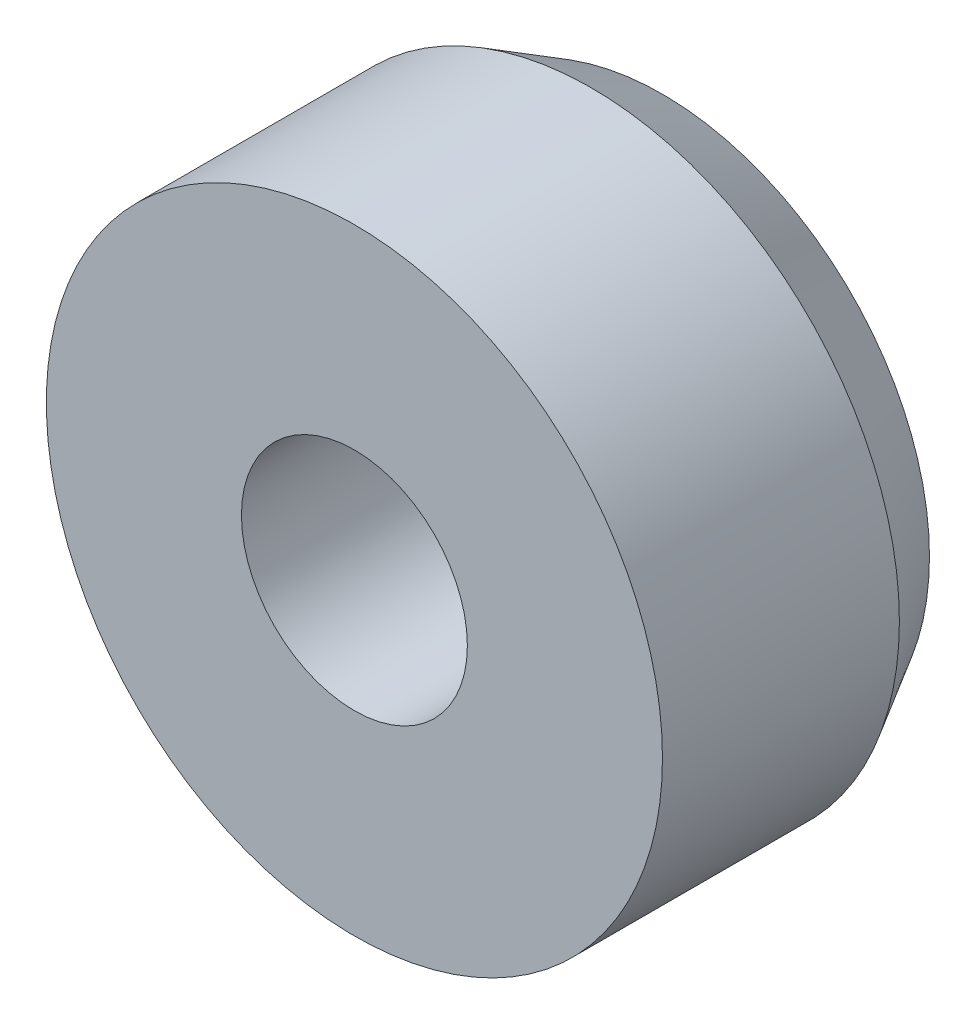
ISO-10303-21;
HEADER;
FILE_DESCRIPTION(('STEP AP214'),'2;1');
FILE_NAME('part.step','',(''),(''),'','','');
FILE_SCHEMA(('AUTOMOTIVE_DESIGN { 1 0 10303 214 1 1 1 1 }'));
ENDSEC;
DATA;
#1=APPLICATION_CONTEXT('core data for automotive mechanical design processes');
#2=APPLICATION_PROTOCOL_DEFINITION('international standard','automotive_design',2000,#1);
#3=PRODUCT_CONTEXT('',#1,'mechanical');
#4=PRODUCT('Part','Part','',(#3));
#5=PRODUCT_RELATED_PRODUCT_CATEGORY('part','',(#4));
#6=PRODUCT_DEFINITION_FORMATION('','',#4);
#7=PRODUCT_DEFINITION_CONTEXT('part definition',#1,'design');
#8=PRODUCT_DEFINITION('design','',#6,#7);
#9=PRODUCT_DEFINITION_SHAPE('','',#8);
#10=(LENGTH_UNIT() NAMED_UNIT(*) SI_UNIT(.MILLI.,.METRE.));
#11=(NAMED_UNIT(*) PLANE_ANGLE_UNIT() SI_UNIT($,.RADIAN.));
#12=(NAMED_UNIT(*) SI_UNIT($,.STERADIAN.) SOLID_ANGLE_UNIT());
#13=UNCERTAINTY_MEASURE_WITH_UNIT(LENGTH_MEASURE(1.E-05),#10,'distance_accuracy_value','');
#14=(GEOMETRIC_REPRESENTATION_CONTEXT(3) GLOBAL_UNCERTAINTY_ASSIGNED_CONTEXT((#13)) GLOBAL_UNIT_ASSIGNED_CONTEXT((#10,
#11,#12)) REPRESENTATION_CONTEXT('',''));
#15=CARTESIAN_POINT('',(0.,0.,0.));
#16=DIRECTION('',(0.,0.,1.));
#17=DIRECTION('',(1.,0.,0.));
#18=AXIS2_PLACEMENT_3D('',#15,#16,#17);
#19=CARTESIAN_POINT('',(0.,0.,15.));
#20=DIRECTION('',(0.,0.,-1.));
#21=DIRECTION('',(-1.,0.,0.));
#22=AXIS2_PLACEMENT_3D('',#19,#20,#21);
#23=CYLINDRICAL_SURFACE('',#22,5.5);
#24=CARTESIAN_POINT('',(0.,0.,15.));
#25=DIRECTION('',(0.,0.,1.));
#26=DIRECTION('',(1.,0.,0.));
#27=AXIS2_PLACEMENT_3D('',#24,#25,#26);
#28=CIRCLE('',#27,5.5);
#29=CARTESIAN_POINT('',(5.5,0.,15.));
#30=VERTEX_POINT('',#29);
#31=EDGE_CURVE('E44',#30,#30,#28,.T.);
#32=ORIENTED_EDGE('',*,*,#31,.T.);
#33=EDGE_LOOP('',(#32));
#34=FACE_BOUND('',#33,.T.);
#35=CARTESIAN_POINT('',(0.,0.,4.));
#36=DIRECTION('',(0.,0.,-1.));
#37=DIRECTION('',(-1.,0.,0.));
#38=AXIS2_PLACEMENT_3D('',#35,#36,#37);
#39=CIRCLE('',#38,5.5);
#40=CARTESIAN_POINT('',(-5.5,0.,4.));
#41=VERTEX_POINT('',#40);
#42=EDGE_CURVE('E47',#41,#41,#39,.T.);
#43=ORIENTED_EDGE('',*,*,#42,.T.);
#44=EDGE_LOOP('',(#43));
#45=FACE_BOUND('',#44,.T.);
#46=ADVANCED_FACE('F29',(#34,#45),#23,.F.);
#47=CARTESIAN_POINT('',(0.,0.,15.));
#48=DIRECTION('',(0.,0.,1.));
#49=DIRECTION('',(1.,0.,0.));
#50=AXIS2_PLACEMENT_3D('',#47,#48,#49);
#51=PLANE('',#50);
#52=CARTESIAN_POINT('',(0.,0.,15.));
#53=DIRECTION('',(0.,0.,1.));
#54=DIRECTION('',(1.,0.,0.));
#55=AXIS2_PLACEMENT_3D('',#52,#53,#54);
#56=CIRCLE('',#55,15.);
#57=CARTESIAN_POINT('',(15.,0.,15.));
#58=VERTEX_POINT('',#57);
#59=EDGE_CURVE('E40',#58,#58,#56,.T.);
#60=ORIENTED_EDGE('',*,*,#59,.T.);
#61=EDGE_LOOP('',(#60));
#62=FACE_BOUND('',#61,.T.);
#63=ORIENTED_EDGE('',*,*,#31,.F.);
#64=EDGE_LOOP('',(#63));
#65=FACE_BOUND('',#64,.T.);
#66=ADVANCED_FACE('F63',(#62,#65),#51,.T.);
#67=CARTESIAN_POINT('',(0.,0.,0.));
#68=DIRECTION('',(0.,0.,1.));
#69=DIRECTION('',(1.,0.,0.));
#70=AXIS2_PLACEMENT_3D('',#67,#68,#69);
#71=PLANE('',#70);
#72=CARTESIAN_POINT('',(0.,0.,0.));
#73=DIRECTION('',(0.,0.,1.));
#74=DIRECTION('',(1.,0.,0.));
#75=AXIS2_PLACEMENT_3D('',#72,#73,#74);
#76=CIRCLE('',#75,13.);
#77=CARTESIAN_POINT('',(13.,0.,0.));
#78=VERTEX_POINT('',#77);
#79=EDGE_CURVE('E10',#78,#78,#76,.F.);
#80=ORIENTED_EDGE('',*,*,#79,.T.);
#81=EDGE_LOOP('',(#80));
#82=FACE_BOUND('',#81,.T.);
#83=CARTESIAN_POINT('',(0.,0.,0.));
#84=DIRECTION('',(0.,0.,-1.));
#85=DIRECTION('',(-1.,0.,0.));
#86=AXIS2_PLACEMENT_3D('',#83,#84,#85);
#87=CIRCLE('',#86,8.5);
#88=CARTESIAN_POINT('',(-8.5,0.,0.));
#89=VERTEX_POINT('',#88);
#90=EDGE_CURVE('E55',#89,#89,#87,.T.);
#91=ORIENTED_EDGE('',*,*,#90,.F.);
#92=EDGE_LOOP('',(#91));
#93=FACE_BOUND('',#92,.T.);
#94=ADVANCED_FACE('F61',(#82,#93),#71,.F.);
#95=CARTESIAN_POINT('',(0.,0.,15.));
#96=DIRECTION('',(0.,0.,-1.));
#97=DIRECTION('',(-1.,0.,0.));
#98=AXIS2_PLACEMENT_3D('',#95,#96,#97);
#99=CYLINDRICAL_SURFACE('',#98,15.);
#100=CARTESIAN_POINT('',(0.,0.,3.46410161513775));
#101=DIRECTION('',(0.,0.,1.));
#102=DIRECTION('',(1.,0.,0.));
#103=AXIS2_PLACEMENT_3D('',#100,#101,#102);
#104=CIRCLE('',#103,15.);
#105=CARTESIAN_POINT('',(15.,0.,3.46410161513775));
#106=VERTEX_POINT('',#105);
#107=EDGE_CURVE('E36',#106,#106,#104,.T.);
#108=ORIENTED_EDGE('',*,*,#107,.T.);
#109=EDGE_LOOP('',(#108));
#110=FACE_BOUND('',#109,.T.);
#111=ORIENTED_EDGE('',*,*,#59,.F.);
#112=EDGE_LOOP('',(#111));
#113=FACE_BOUND('',#112,.T.);
#114=ADVANCED_FACE('F31',(#110,#113),#99,.T.);
#115=CARTESIAN_POINT('',(0.,0.,4.));
#116=DIRECTION('',(0.,0.,-1.));
#117=DIRECTION('',(-1.,0.,0.));
#118=AXIS2_PLACEMENT_3D('',#115,#116,#117);
#119=CYLINDRICAL_SURFACE('',#118,8.5);
#120=CARTESIAN_POINT('',(0.,0.,4.));
#121=DIRECTION('',(0.,0.,-1.));
#122=DIRECTION('',(-1.,0.,0.));
#123=AXIS2_PLACEMENT_3D('',#120,#121,#122);
#124=CIRCLE('',#123,8.5);
#125=CARTESIAN_POINT('',(-8.5,0.,4.));
#126=VERTEX_POINT('',#125);
#127=EDGE_CURVE('E49',#126,#126,#124,.T.);
#128=ORIENTED_EDGE('',*,*,#127,.F.);
#129=EDGE_LOOP('',(#128));
#130=FACE_BOUND('',#129,.T.);
#131=ORIENTED_EDGE('',*,*,#90,.T.);
#132=EDGE_LOOP('',(#131));
#133=FACE_BOUND('',#132,.T.);
#134=ADVANCED_FACE('F59',(#130,#133),#119,.F.);
#135=CARTESIAN_POINT('',(0.,0.,4.));
#136=DIRECTION('',(0.,0.,-1.));
#137=DIRECTION('',(-1.,0.,0.));
#138=AXIS2_PLACEMENT_3D('',#135,#136,#137);
#139=PLANE('',#138);
#140=ORIENTED_EDGE('',*,*,#42,.F.);
#141=EDGE_LOOP('',(#140));
#142=FACE_BOUND('',#141,.T.);
#143=ORIENTED_EDGE('',*,*,#127,.T.);
#144=EDGE_LOOP('',(#143));
#145=FACE_BOUND('',#144,.T.);
#146=ADVANCED_FACE('F79',(#142,#145),#139,.T.);
#147=CARTESIAN_POINT('',(0.,0.,3.46410161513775));
#148=DIRECTION('',(0.,0.,1.));
#149=DIRECTION('',(1.,0.,0.));
#150=AXIS2_PLACEMENT_3D('',#147,#148,#149);
#151=CONICAL_SURFACE('',#150,15.,0.5235987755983);
#152=ORIENTED_EDGE('',*,*,#79,.F.);
#153=EDGE_LOOP('',(#152));
#154=FACE_BOUND('',#153,.T.);
#155=ORIENTED_EDGE('',*,*,#107,.F.);
#156=EDGE_LOOP('',(#155));
#157=FACE_BOUND('',#156,.T.);
#158=ADVANCED_FACE('F83',(#154,#157),#151,.T.);
#159=CLOSED_SHELL('',(#46,#66,#94,#114,#134,#146,#158));
#160=MANIFOLD_SOLID_BREP('B2',#159);
#161=ADVANCED_BREP_SHAPE_REPRESENTATION('',(#18,#160),#14);
#162=SHAPE_DEFINITION_REPRESENTATION(#9,#161);
ENDSEC;
END-ISO-10303-21;
